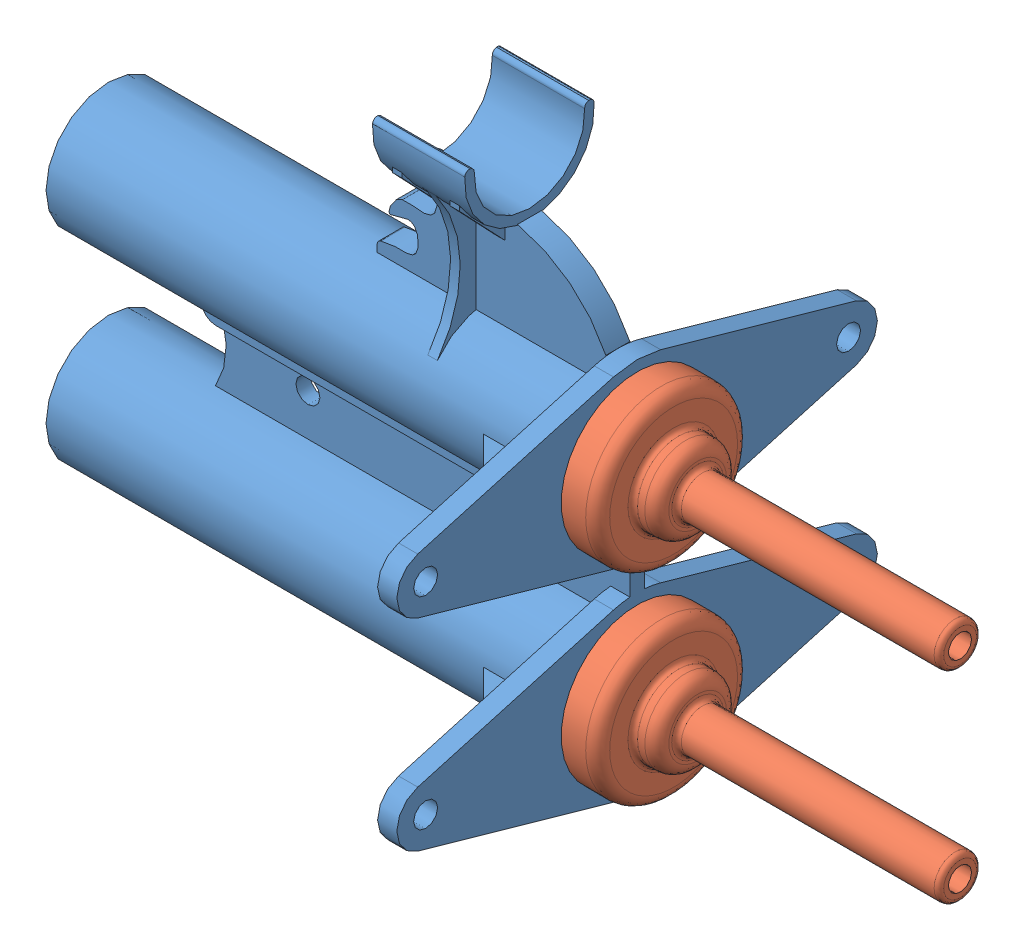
SolidWorks assembly Center.SLDASM, configuration Default (file format 3100). Lengths in mm.
Overall size (112.52 68.17 63.5).
3 component instances, 2 part files, 6 mates.
Components (placement in the parent):
- Main Body-1: Main Body.SLDPRT [Best] at origin size (71.75 68.17 63.5)
- Nozzle-1: Nozzle.SLDPRT [Default] x (0 -1 0) z (0 0 1) size (20.07 42.67 20.07)
- Nozzle-2: Nozzle.SLDPRT [Default] at (0 26.67 0) x (0 -1 0) z (0 0 1) size (20.07 42.67 20.07)
Mates (geometry in assembly coordinates):
- Concentric1: concentric aligned: cylinder of Main Body-1; cylinder of Nozzle-1
- Coincident1: coincident anti-aligned: plane of Main Body-1; plane of Nozzle-1
- Parallel1: parallel aligned: plane of Main Body-1; plane of Nozzle-1
- Concentric2: concentric aligned: cylinder of Main Body-1; cylinder of Nozzle-2
- Coincident2: coincident anti-aligned: plane of Main Body-1; plane of Nozzle-2
- Parallel2: parallel aligned: plane of Main Body-1; plane of Nozzle-2
